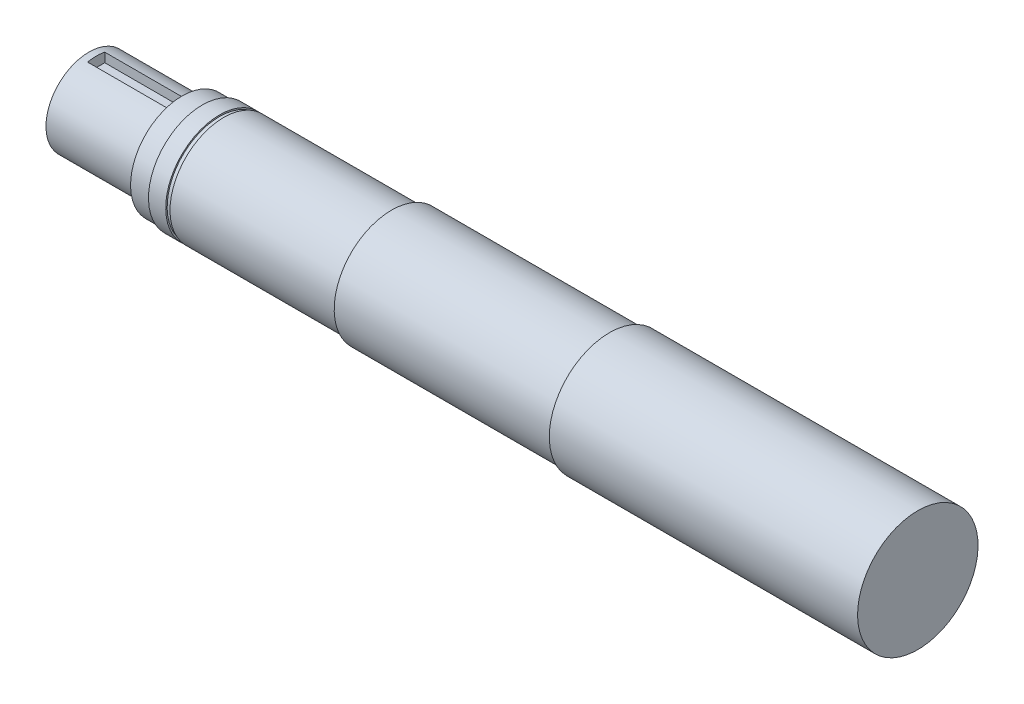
ISO-10303-21;
HEADER;
FILE_DESCRIPTION(('STEP AP214'),'2;1');
FILE_NAME('part.step','',(''),(''),'','','');
FILE_SCHEMA(('AUTOMOTIVE_DESIGN { 1 0 10303 214 1 1 1 1 }'));
ENDSEC;
DATA;
#1=APPLICATION_CONTEXT('core data for automotive mechanical design processes');
#2=APPLICATION_PROTOCOL_DEFINITION('international standard','automotive_design',2000,#1);
#3=PRODUCT_CONTEXT('',#1,'mechanical');
#4=PRODUCT('Part','Part','',(#3));
#5=PRODUCT_RELATED_PRODUCT_CATEGORY('part','',(#4));
#6=PRODUCT_DEFINITION_FORMATION('','',#4);
#7=PRODUCT_DEFINITION_CONTEXT('part definition',#1,'design');
#8=PRODUCT_DEFINITION('design','',#6,#7);
#9=PRODUCT_DEFINITION_SHAPE('','',#8);
#10=(LENGTH_UNIT() NAMED_UNIT(*) SI_UNIT(.MILLI.,.METRE.));
#11=(NAMED_UNIT(*) PLANE_ANGLE_UNIT() SI_UNIT($,.RADIAN.));
#12=(NAMED_UNIT(*) SI_UNIT($,.STERADIAN.) SOLID_ANGLE_UNIT());
#13=UNCERTAINTY_MEASURE_WITH_UNIT(LENGTH_MEASURE(1.E-05),#10,'distance_accuracy_value','');
#14=(GEOMETRIC_REPRESENTATION_CONTEXT(3) GLOBAL_UNCERTAINTY_ASSIGNED_CONTEXT((#13)) GLOBAL_UNIT_ASSIGNED_CONTEXT((#10,
#11,#12)) REPRESENTATION_CONTEXT('',''));
#15=CARTESIAN_POINT('',(0.,0.,0.));
#16=DIRECTION('',(0.,0.,1.));
#17=DIRECTION('',(1.,0.,0.));
#18=AXIS2_PLACEMENT_3D('',#15,#16,#17);
#19=CARTESIAN_POINT('',(0.,0.,0.));
#20=DIRECTION('',(1.,0.,0.));
#21=DIRECTION('',(0.,1.,0.));
#22=AXIS2_PLACEMENT_3D('',#19,#20,#21);
#23=CYLINDRICAL_SURFACE('',#22,30.);
#24=CARTESIAN_POINT('',(-578.,0.,0.));
#25=DIRECTION('',(1.,0.,0.));
#26=DIRECTION('',(0.,1.,0.));
#27=AXIS2_PLACEMENT_3D('',#24,#25,#26);
#28=CIRCLE('',#27,30.);
#29=CARTESIAN_POINT('',(-578.,29.9999999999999,0.));
#30=VERTEX_POINT('',#29);
#31=EDGE_CURVE('E137',#30,#30,#28,.T.);
#32=ORIENTED_EDGE('',*,*,#31,.T.);
#33=EDGE_LOOP('',(#32));
#34=FACE_BOUND('',#33,.T.);
#35=CARTESIAN_POINT('',(-573.,0.,0.));
#36=DIRECTION('',(1.,0.,0.));
#37=DIRECTION('',(0.,0.,-1.));
#38=AXIS2_PLACEMENT_3D('',#35,#36,#37);
#39=CIRCLE('',#38,30.);
#40=CARTESIAN_POINT('',(-573.,29.3938769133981,6.00000000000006));
#41=VERTEX_POINT('',#40);
#42=CARTESIAN_POINT('',(-573.,29.3938769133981,-5.99999999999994));
#43=VERTEX_POINT('',#42);
#44=EDGE_CURVE('E11',#41,#43,#39,.F.);
#45=ORIENTED_EDGE('',*,*,#44,.T.);
#46=DIRECTION('',(1.,0.,0.));
#47=VECTOR('',#46,1.);
#48=CARTESIAN_POINT('',(0.,29.3938769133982,-5.99999999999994));
#49=LINE('',#48,#47);
#50=CARTESIAN_POINT('',(-513.,29.3938769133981,-5.99999999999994));
#51=VERTEX_POINT('',#50);
#52=EDGE_CURVE('E55',#43,#51,#49,.T.);
#53=ORIENTED_EDGE('',*,*,#52,.T.);
#54=CARTESIAN_POINT('',(-513.,0.,0.));
#55=DIRECTION('',(1.,0.,0.));
#56=DIRECTION('',(0.,1.,0.));
#57=AXIS2_PLACEMENT_3D('',#54,#55,#56);
#58=CIRCLE('',#57,30.);
#59=CARTESIAN_POINT('',(-513.,29.3938769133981,6.00000000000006));
#60=VERTEX_POINT('',#59);
#61=EDGE_CURVE('E80',#60,#51,#58,.T.);
#62=ORIENTED_EDGE('',*,*,#61,.F.);
#63=DIRECTION('',(1.,0.,0.));
#64=VECTOR('',#63,1.);
#65=CARTESIAN_POINT('',(0.,29.3938769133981,6.00000000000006));
#66=LINE('',#65,#64);
#67=EDGE_CURVE('E81',#60,#41,#66,.F.);
#68=ORIENTED_EDGE('',*,*,#67,.T.);
#69=EDGE_LOOP('',(#45,#53,#62,#68));
#70=FACE_BOUND('',#69,.T.);
#71=ADVANCED_FACE('F32',(#34,#70),#23,.T.);
#72=CARTESIAN_POINT('',(-215.,40.,0.));
#73=DIRECTION('',(-1.,0.,0.));
#74=DIRECTION('',(0.,-1.,0.));
#75=AXIS2_PLACEMENT_3D('',#72,#73,#74);
#76=PLANE('',#75);
#77=CARTESIAN_POINT('',(-215.,0.,0.));
#78=DIRECTION('',(1.,0.,0.));
#79=DIRECTION('',(0.,1.,0.));
#80=AXIS2_PLACEMENT_3D('',#77,#78,#79);
#81=CIRCLE('',#80,40.);
#82=CARTESIAN_POINT('',(-215.,40.,0.));
#83=VERTEX_POINT('',#82);
#84=EDGE_CURVE('E106',#83,#83,#81,.T.);
#85=ORIENTED_EDGE('',*,*,#84,.T.);
#86=EDGE_LOOP('',(#85));
#87=FACE_BOUND('',#86,.T.);
#88=CARTESIAN_POINT('',(-215.,0.,0.));
#89=DIRECTION('',(1.,0.,0.));
#90=DIRECTION('',(0.,1.,0.));
#91=AXIS2_PLACEMENT_3D('',#88,#89,#90);
#92=CIRCLE('',#91,42.);
#93=CARTESIAN_POINT('',(-215.,42.,0.));
#94=VERTEX_POINT('',#93);
#95=EDGE_CURVE('E40',#94,#94,#92,.T.);
#96=ORIENTED_EDGE('',*,*,#95,.F.);
#97=EDGE_LOOP('',(#96));
#98=FACE_BOUND('',#97,.T.);
#99=ADVANCED_FACE('F34',(#87,#98),#76,.T.);
#100=CARTESIAN_POINT('',(0.,0.,0.));
#101=DIRECTION('',(1.,0.,0.));
#102=DIRECTION('',(0.,1.,0.));
#103=AXIS2_PLACEMENT_3D('',#100,#101,#102);
#104=CYLINDRICAL_SURFACE('',#103,42.);
#105=ORIENTED_EDGE('',*,*,#95,.T.);
#106=EDGE_LOOP('',(#105));
#107=FACE_BOUND('',#106,.T.);
#108=CARTESIAN_POINT('',(0.,0.,0.));
#109=DIRECTION('',(1.,0.,0.));
#110=DIRECTION('',(0.,1.,0.));
#111=AXIS2_PLACEMENT_3D('',#108,#109,#110);
#112=CIRCLE('',#111,42.);
#113=CARTESIAN_POINT('',(0.,42.,0.));
#114=VERTEX_POINT('',#113);
#115=EDGE_CURVE('E140',#114,#114,#112,.T.);
#116=ORIENTED_EDGE('',*,*,#115,.F.);
#117=EDGE_LOOP('',(#116));
#118=FACE_BOUND('',#117,.T.);
#119=ADVANCED_FACE('F145',(#107,#118),#104,.T.);
#120=CARTESIAN_POINT('',(0.,42.,0.));
#121=DIRECTION('',(1.,0.,0.));
#122=DIRECTION('',(0.,1.,0.));
#123=AXIS2_PLACEMENT_3D('',#120,#121,#122);
#124=PLANE('',#123);
#125=ORIENTED_EDGE('',*,*,#115,.T.);
#126=EDGE_LOOP('',(#125));
#127=FACE_BOUND('',#126,.T.);
#128=ADVANCED_FACE('F154',(#127),#124,.T.);
#129=CARTESIAN_POINT('',(-578.,29.9999999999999,0.));
#130=DIRECTION('',(-1.,0.,0.));
#131=DIRECTION('',(0.,-1.,0.));
#132=AXIS2_PLACEMENT_3D('',#129,#130,#131);
#133=PLANE('',#132);
#134=ORIENTED_EDGE('',*,*,#31,.F.);
#135=EDGE_LOOP('',(#134));
#136=FACE_BOUND('',#135,.T.);
#137=ADVANCED_FACE('F203',(#136),#133,.T.);
#138=CARTESIAN_POINT('',(-513.,35.9999999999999,0.));
#139=DIRECTION('',(-1.,0.,0.));
#140=DIRECTION('',(0.,-1.,0.));
#141=AXIS2_PLACEMENT_3D('',#138,#139,#140);
#142=PLANE('',#141);
#143=CARTESIAN_POINT('',(-513.,0.,0.));
#144=DIRECTION('',(1.,0.,0.));
#145=DIRECTION('',(0.,1.,0.));
#146=AXIS2_PLACEMENT_3D('',#143,#144,#145);
#147=CIRCLE('',#146,36.);
#148=CARTESIAN_POINT('',(-513.,35.9999999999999,0.));
#149=VERTEX_POINT('',#148);
#150=EDGE_CURVE('E133',#149,#149,#147,.T.);
#151=ORIENTED_EDGE('',*,*,#150,.F.);
#152=EDGE_LOOP('',(#151));
#153=FACE_BOUND('',#152,.T.);
#154=ORIENTED_EDGE('',*,*,#61,.T.);
#155=DIRECTION('',(0.,-1.,0.));
#156=VECTOR('',#155,1.);
#157=CARTESIAN_POINT('',(-513.,42.,-5.99999999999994));
#158=LINE('',#157,#156);
#159=CARTESIAN_POINT('',(-513.,23.,-5.99999999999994));
#160=VERTEX_POINT('',#159);
#161=EDGE_CURVE('E73',#51,#160,#158,.T.);
#162=ORIENTED_EDGE('',*,*,#161,.T.);
#163=DIRECTION('',(0.,0.,-1.));
#164=VECTOR('',#163,1.);
#165=CARTESIAN_POINT('',(-513.,23.,6.00000000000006));
#166=LINE('',#165,#164);
#167=CARTESIAN_POINT('',(-513.,23.,6.00000000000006));
#168=VERTEX_POINT('',#167);
#169=EDGE_CURVE('E78',#168,#160,#166,.T.);
#170=ORIENTED_EDGE('',*,*,#169,.F.);
#171=DIRECTION('',(0.,-1.,0.));
#172=VECTOR('',#171,1.);
#173=CARTESIAN_POINT('',(-513.,42.,6.00000000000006));
#174=LINE('',#173,#172);
#175=EDGE_CURVE('E99',#60,#168,#174,.T.);
#176=ORIENTED_EDGE('',*,*,#175,.F.);
#177=EDGE_LOOP('',(#154,#162,#170,#176));
#178=FACE_BOUND('',#177,.T.);
#179=ADVANCED_FACE('F75',(#153,#178),#142,.T.);
#180=CARTESIAN_POINT('',(0.,0.,0.));
#181=DIRECTION('',(1.,0.,0.));
#182=DIRECTION('',(0.,1.,0.));
#183=AXIS2_PLACEMENT_3D('',#180,#181,#182);
#184=CYLINDRICAL_SURFACE('',#183,36.);
#185=ORIENTED_EDGE('',*,*,#150,.T.);
#186=EDGE_LOOP('',(#185));
#187=FACE_BOUND('',#186,.T.);
#188=CARTESIAN_POINT('',(-499.,0.,0.));
#189=DIRECTION('',(1.,0.,0.));
#190=DIRECTION('',(0.,1.,0.));
#191=AXIS2_PLACEMENT_3D('',#188,#189,#190);
#192=CIRCLE('',#191,36.);
#193=CARTESIAN_POINT('',(-499.,35.9999999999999,0.));
#194=VERTEX_POINT('',#193);
#195=EDGE_CURVE('E130',#194,#194,#192,.T.);
#196=ORIENTED_EDGE('',*,*,#195,.F.);
#197=EDGE_LOOP('',(#196));
#198=FACE_BOUND('',#197,.T.);
#199=ADVANCED_FACE('F197',(#187,#198),#184,.T.);
#200=CARTESIAN_POINT('',(-499.,35.9999999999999,0.));
#201=DIRECTION('',(-1.,0.,0.));
#202=DIRECTION('',(0.,-1.,0.));
#203=AXIS2_PLACEMENT_3D('',#200,#201,#202);
#204=PLANE('',#203);
#205=ORIENTED_EDGE('',*,*,#195,.T.);
#206=EDGE_LOOP('',(#205));
#207=FACE_BOUND('',#206,.T.);
#208=CARTESIAN_POINT('',(-499.,0.,0.));
#209=DIRECTION('',(1.,0.,0.));
#210=DIRECTION('',(0.,1.,0.));
#211=AXIS2_PLACEMENT_3D('',#208,#209,#210);
#212=CIRCLE('',#211,37.5);
#213=CARTESIAN_POINT('',(-499.,37.4999999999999,0.));
#214=VERTEX_POINT('',#213);
#215=EDGE_CURVE('E127',#214,#214,#212,.T.);
#216=ORIENTED_EDGE('',*,*,#215,.F.);
#217=EDGE_LOOP('',(#216));
#218=FACE_BOUND('',#217,.T.);
#219=ADVANCED_FACE('F193',(#207,#218),#204,.T.);
#220=CARTESIAN_POINT('',(0.,0.,0.));
#221=DIRECTION('',(1.,0.,0.));
#222=DIRECTION('',(0.,1.,0.));
#223=AXIS2_PLACEMENT_3D('',#220,#221,#222);
#224=CYLINDRICAL_SURFACE('',#223,37.5);
#225=ORIENTED_EDGE('',*,*,#215,.T.);
#226=EDGE_LOOP('',(#225));
#227=FACE_BOUND('',#226,.T.);
#228=CARTESIAN_POINT('',(-487.,0.,0.));
#229=DIRECTION('',(1.,0.,0.));
#230=DIRECTION('',(0.,1.,0.));
#231=AXIS2_PLACEMENT_3D('',#228,#229,#230);
#232=CIRCLE('',#231,37.5);
#233=CARTESIAN_POINT('',(-487.,37.4999999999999,0.));
#234=VERTEX_POINT('',#233);
#235=EDGE_CURVE('E124',#234,#234,#232,.T.);
#236=ORIENTED_EDGE('',*,*,#235,.F.);
#237=EDGE_LOOP('',(#236));
#238=FACE_BOUND('',#237,.T.);
#239=ADVANCED_FACE('F189',(#227,#238),#224,.T.);
#240=CARTESIAN_POINT('',(-487.,37.4999999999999,0.));
#241=DIRECTION('',(1.,0.,0.));
#242=DIRECTION('',(0.,1.,0.));
#243=AXIS2_PLACEMENT_3D('',#240,#241,#242);
#244=PLANE('',#243);
#245=ORIENTED_EDGE('',*,*,#235,.T.);
#246=EDGE_LOOP('',(#245));
#247=FACE_BOUND('',#246,.T.);
#248=CARTESIAN_POINT('',(-487.,0.,0.));
#249=DIRECTION('',(1.,0.,0.));
#250=DIRECTION('',(0.,1.,0.));
#251=AXIS2_PLACEMENT_3D('',#248,#249,#250);
#252=CIRCLE('',#251,36.4999999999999);
#253=CARTESIAN_POINT('',(-487.,36.4999999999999,0.));
#254=VERTEX_POINT('',#253);
#255=EDGE_CURVE('E121',#254,#254,#252,.T.);
#256=ORIENTED_EDGE('',*,*,#255,.F.);
#257=EDGE_LOOP('',(#256));
#258=FACE_BOUND('',#257,.T.);
#259=ADVANCED_FACE('F185',(#247,#258),#244,.T.);
#260=CARTESIAN_POINT('',(0.,0.,0.));
#261=DIRECTION('',(1.,0.,0.));
#262=DIRECTION('',(0.,1.,0.));
#263=AXIS2_PLACEMENT_3D('',#260,#261,#262);
#264=CYLINDRICAL_SURFACE('',#263,36.5);
#265=ORIENTED_EDGE('',*,*,#255,.T.);
#266=EDGE_LOOP('',(#265));
#267=FACE_BOUND('',#266,.T.);
#268=CARTESIAN_POINT('',(-484.,0.,0.));
#269=DIRECTION('',(1.,0.,0.));
#270=DIRECTION('',(0.,1.,0.));
#271=AXIS2_PLACEMENT_3D('',#268,#269,#270);
#272=CIRCLE('',#271,36.5);
#273=CARTESIAN_POINT('',(-484.,36.4999999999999,0.));
#274=VERTEX_POINT('',#273);
#275=EDGE_CURVE('E118',#274,#274,#272,.T.);
#276=ORIENTED_EDGE('',*,*,#275,.F.);
#277=EDGE_LOOP('',(#276));
#278=FACE_BOUND('',#277,.T.);
#279=ADVANCED_FACE('F181',(#267,#278),#264,.T.);
#280=CARTESIAN_POINT('',(-484.,37.4999999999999,0.));
#281=DIRECTION('',(-1.,0.,0.));
#282=DIRECTION('',(0.,-1.,0.));
#283=AXIS2_PLACEMENT_3D('',#280,#281,#282);
#284=PLANE('',#283);
#285=ORIENTED_EDGE('',*,*,#275,.T.);
#286=EDGE_LOOP('',(#285));
#287=FACE_BOUND('',#286,.T.);
#288=CARTESIAN_POINT('',(-484.,0.,0.));
#289=DIRECTION('',(1.,0.,0.));
#290=DIRECTION('',(0.,1.,0.));
#291=AXIS2_PLACEMENT_3D('',#288,#289,#290);
#292=CIRCLE('',#291,37.5);
#293=CARTESIAN_POINT('',(-484.,37.4999999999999,0.));
#294=VERTEX_POINT('',#293);
#295=EDGE_CURVE('E115',#294,#294,#292,.T.);
#296=ORIENTED_EDGE('',*,*,#295,.F.);
#297=EDGE_LOOP('',(#296));
#298=FACE_BOUND('',#297,.T.);
#299=ADVANCED_FACE('F177',(#287,#298),#284,.T.);
#300=CARTESIAN_POINT('',(0.,0.,0.));
#301=DIRECTION('',(1.,0.,0.));
#302=DIRECTION('',(0.,1.,0.));
#303=AXIS2_PLACEMENT_3D('',#300,#301,#302);
#304=CYLINDRICAL_SURFACE('',#303,37.5);
#305=ORIENTED_EDGE('',*,*,#295,.T.);
#306=EDGE_LOOP('',(#305));
#307=FACE_BOUND('',#306,.T.);
#308=CARTESIAN_POINT('',(-367.,0.,0.));
#309=DIRECTION('',(1.,0.,0.));
#310=DIRECTION('',(0.,1.,0.));
#311=AXIS2_PLACEMENT_3D('',#308,#309,#310);
#312=CIRCLE('',#311,37.5);
#313=CARTESIAN_POINT('',(-367.,37.5,0.));
#314=VERTEX_POINT('',#313);
#315=EDGE_CURVE('E112',#314,#314,#312,.T.);
#316=ORIENTED_EDGE('',*,*,#315,.F.);
#317=EDGE_LOOP('',(#316));
#318=FACE_BOUND('',#317,.T.);
#319=ADVANCED_FACE('F170',(#307,#318),#304,.T.);
#320=CARTESIAN_POINT('',(-367.,39.9999999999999,0.));
#321=DIRECTION('',(-1.,0.,0.));
#322=DIRECTION('',(0.,-1.,0.));
#323=AXIS2_PLACEMENT_3D('',#320,#321,#322);
#324=PLANE('',#323);
#325=ORIENTED_EDGE('',*,*,#315,.T.);
#326=EDGE_LOOP('',(#325));
#327=FACE_BOUND('',#326,.T.);
#328=CARTESIAN_POINT('',(-367.,0.,0.));
#329=DIRECTION('',(1.,0.,0.));
#330=DIRECTION('',(0.,1.,0.));
#331=AXIS2_PLACEMENT_3D('',#328,#329,#330);
#332=CIRCLE('',#331,40.);
#333=CARTESIAN_POINT('',(-367.,39.9999999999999,0.));
#334=VERTEX_POINT('',#333);
#335=EDGE_CURVE('E109',#334,#334,#332,.T.);
#336=ORIENTED_EDGE('',*,*,#335,.F.);
#337=EDGE_LOOP('',(#336));
#338=FACE_BOUND('',#337,.T.);
#339=ADVANCED_FACE('F161',(#327,#338),#324,.T.);
#340=CARTESIAN_POINT('',(0.,0.,0.));
#341=DIRECTION('',(1.,0.,0.));
#342=DIRECTION('',(0.,1.,0.));
#343=AXIS2_PLACEMENT_3D('',#340,#341,#342);
#344=CYLINDRICAL_SURFACE('',#343,40.);
#345=ORIENTED_EDGE('',*,*,#335,.T.);
#346=EDGE_LOOP('',(#345));
#347=FACE_BOUND('',#346,.T.);
#348=ORIENTED_EDGE('',*,*,#84,.F.);
#349=EDGE_LOOP('',(#348));
#350=FACE_BOUND('',#349,.T.);
#351=ADVANCED_FACE('F159',(#347,#350),#344,.T.);
#352=CARTESIAN_POINT('',(-573.,42.,-5.99999999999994));
#353=DIRECTION('',(0.,0.,1.));
#354=DIRECTION('',(1.,0.,0.));
#355=AXIS2_PLACEMENT_3D('',#352,#353,#354);
#356=PLANE('',#355);
#357=DIRECTION('',(0.,-1.,0.));
#358=VECTOR('',#357,1.);
#359=CARTESIAN_POINT('',(-573.,42.,-5.99999999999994));
#360=LINE('',#359,#358);
#361=CARTESIAN_POINT('',(-573.,23.,-5.99999999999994));
#362=VERTEX_POINT('',#361);
#363=EDGE_CURVE('E82',#43,#362,#360,.T.);
#364=ORIENTED_EDGE('',*,*,#363,.T.);
#365=DIRECTION('',(-1.,0.,0.));
#366=VECTOR('',#365,1.);
#367=CARTESIAN_POINT('',(-573.,23.,-5.99999999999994));
#368=LINE('',#367,#366);
#369=EDGE_CURVE('E85',#160,#362,#368,.T.);
#370=ORIENTED_EDGE('',*,*,#369,.F.);
#371=ORIENTED_EDGE('',*,*,#161,.F.);
#372=ORIENTED_EDGE('',*,*,#52,.F.);
#373=EDGE_LOOP('',(#364,#370,#371,#372));
#374=FACE_BOUND('',#373,.T.);
#375=ADVANCED_FACE('F86',(#374),#356,.T.);
#376=CARTESIAN_POINT('',(-573.,42.,6.00000000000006));
#377=DIRECTION('',(1.,0.,0.));
#378=DIRECTION('',(0.,0.,-1.));
#379=AXIS2_PLACEMENT_3D('',#376,#377,#378);
#380=PLANE('',#379);
#381=DIRECTION('',(0.,-1.,0.));
#382=VECTOR('',#381,1.);
#383=CARTESIAN_POINT('',(-573.,42.,6.00000000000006));
#384=LINE('',#383,#382);
#385=CARTESIAN_POINT('',(-573.,23.,6.00000000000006));
#386=VERTEX_POINT('',#385);
#387=EDGE_CURVE('E47',#41,#386,#384,.T.);
#388=ORIENTED_EDGE('',*,*,#387,.T.);
#389=DIRECTION('',(0.,0.,1.));
#390=VECTOR('',#389,1.);
#391=CARTESIAN_POINT('',(-573.,23.,6.00000000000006));
#392=LINE('',#391,#390);
#393=EDGE_CURVE('E90',#362,#386,#392,.T.);
#394=ORIENTED_EDGE('',*,*,#393,.F.);
#395=ORIENTED_EDGE('',*,*,#363,.F.);
#396=ORIENTED_EDGE('',*,*,#44,.F.);
#397=EDGE_LOOP('',(#388,#394,#395,#396));
#398=FACE_BOUND('',#397,.T.);
#399=ADVANCED_FACE('F168',(#398),#380,.T.);
#400=CARTESIAN_POINT('',(-573.,42.,6.00000000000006));
#401=DIRECTION('',(0.,0.,-1.));
#402=DIRECTION('',(-1.,0.,0.));
#403=AXIS2_PLACEMENT_3D('',#400,#401,#402);
#404=PLANE('',#403);
#405=ORIENTED_EDGE('',*,*,#175,.T.);
#406=DIRECTION('',(1.,0.,0.));
#407=VECTOR('',#406,1.);
#408=CARTESIAN_POINT('',(-573.,23.,6.00000000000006));
#409=LINE('',#408,#407);
#410=EDGE_CURVE('E94',#386,#168,#409,.T.);
#411=ORIENTED_EDGE('',*,*,#410,.F.);
#412=ORIENTED_EDGE('',*,*,#387,.F.);
#413=ORIENTED_EDGE('',*,*,#67,.F.);
#414=EDGE_LOOP('',(#405,#411,#412,#413));
#415=FACE_BOUND('',#414,.T.);
#416=ADVANCED_FACE('F286',(#415),#404,.T.);
#417=CARTESIAN_POINT('',(0.,23.,0.));
#418=DIRECTION('',(0.,-1.,0.));
#419=DIRECTION('',(0.,0.,-1.));
#420=AXIS2_PLACEMENT_3D('',#417,#418,#419);
#421=PLANE('',#420);
#422=ORIENTED_EDGE('',*,*,#169,.T.);
#423=ORIENTED_EDGE('',*,*,#369,.T.);
#424=ORIENTED_EDGE('',*,*,#393,.T.);
#425=ORIENTED_EDGE('',*,*,#410,.T.);
#426=EDGE_LOOP('',(#422,#423,#424,#425));
#427=FACE_BOUND('',#426,.T.);
#428=ADVANCED_FACE('F93',(#427),#421,.F.);
#429=CLOSED_SHELL('',(#71,#99,#119,#128,#137,#179,#199,#219,#239,#259,#279,#299,#319,#339,#351,
#375,#399,#416,#428));
#430=MANIFOLD_SOLID_BREP('B2',#429);
#431=ADVANCED_BREP_SHAPE_REPRESENTATION('',(#18,#430),#14);
#432=SHAPE_DEFINITION_REPRESENTATION(#9,#431);
ENDSEC;
END-ISO-10303-21;
